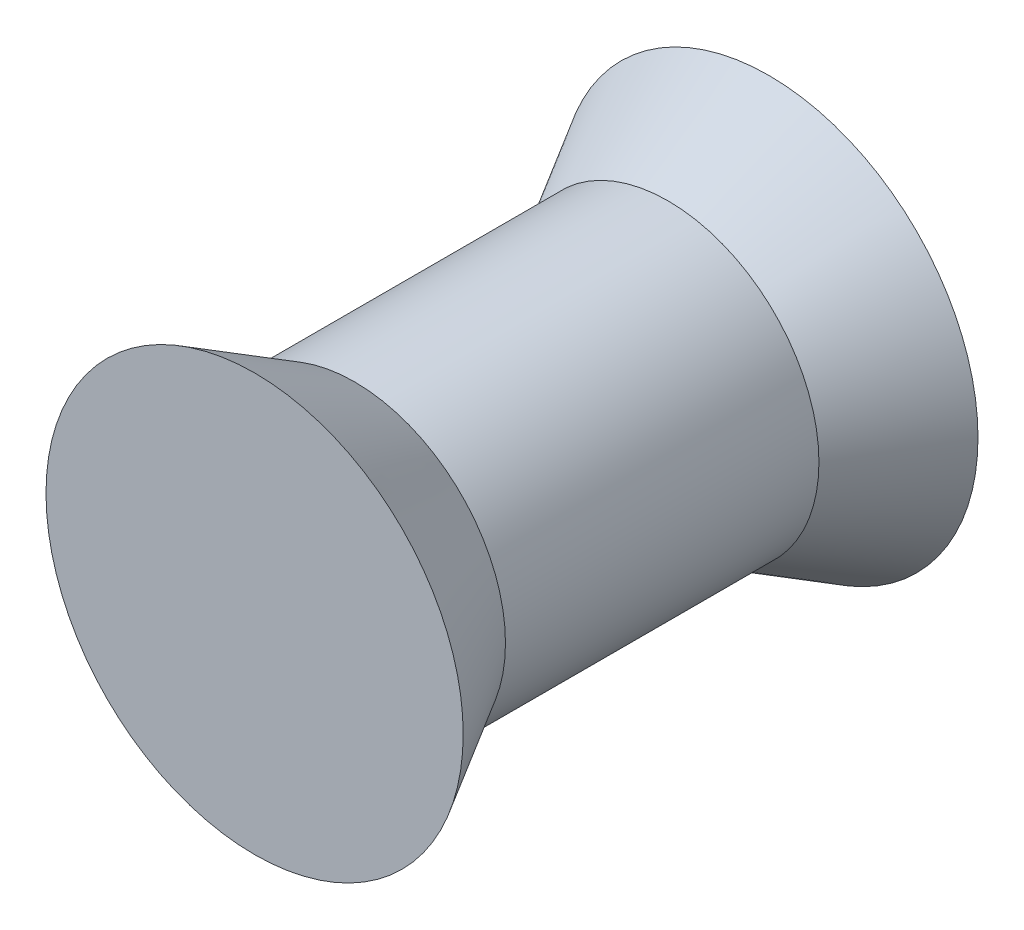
ISO-10303-21;
HEADER;
FILE_DESCRIPTION(('STEP AP214'),'2;1');
FILE_NAME('part.step','',(''),(''),'','','');
FILE_SCHEMA(('AUTOMOTIVE_DESIGN { 1 0 10303 214 1 1 1 1 }'));
ENDSEC;
DATA;
#1=APPLICATION_CONTEXT('core data for automotive mechanical design processes');
#2=APPLICATION_PROTOCOL_DEFINITION('international standard','automotive_design',2000,#1);
#3=PRODUCT_CONTEXT('',#1,'mechanical');
#4=PRODUCT('Part','Part','',(#3));
#5=PRODUCT_RELATED_PRODUCT_CATEGORY('part','',(#4));
#6=PRODUCT_DEFINITION_FORMATION('','',#4);
#7=PRODUCT_DEFINITION_CONTEXT('part definition',#1,'design');
#8=PRODUCT_DEFINITION('design','',#6,#7);
#9=PRODUCT_DEFINITION_SHAPE('','',#8);
#10=(LENGTH_UNIT() NAMED_UNIT(*) SI_UNIT(.MILLI.,.METRE.));
#11=(NAMED_UNIT(*) PLANE_ANGLE_UNIT() SI_UNIT($,.RADIAN.));
#12=(NAMED_UNIT(*) SI_UNIT($,.STERADIAN.) SOLID_ANGLE_UNIT());
#13=UNCERTAINTY_MEASURE_WITH_UNIT(LENGTH_MEASURE(1.E-05),#10,'distance_accuracy_value','');
#14=(GEOMETRIC_REPRESENTATION_CONTEXT(3) GLOBAL_UNCERTAINTY_ASSIGNED_CONTEXT((#13)) GLOBAL_UNIT_ASSIGNED_CONTEXT((#10,
#11,#12)) REPRESENTATION_CONTEXT('',''));
#15=CARTESIAN_POINT('',(0.,0.,0.));
#16=DIRECTION('',(0.,0.,1.));
#17=DIRECTION('',(1.,0.,0.));
#18=AXIS2_PLACEMENT_3D('',#15,#16,#17);
#19=CARTESIAN_POINT('',(0.,0.,-2.66715174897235));
#20=DIRECTION('',(0.,0.,1.));
#21=DIRECTION('',(0.,1.,0.));
#22=AXIS2_PLACEMENT_3D('',#19,#20,#21);
#23=SPHERICAL_SURFACE('',#22,6.35);
#24=CARTESIAN_POINT('',(0.,0.,-8.09752));
#25=DIRECTION('',(0.,0.,1.));
#26=DIRECTION('',(1.,0.,0.));
#27=AXIS2_PLACEMENT_3D('',#24,#25,#26);
#28=CIRCLE('',#27,3.29144355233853);
#29=CARTESIAN_POINT('',(3.29144355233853,0.,-8.09752));
#30=VERTEX_POINT('',#29);
#31=EDGE_CURVE('E10',#30,#30,#28,.T.);
#32=ORIENTED_EDGE('',*,*,#31,.F.);
#33=EDGE_LOOP('',(#32));
#34=FACE_BOUND('',#33,.T.);
#35=ADVANCED_FACE('F35',(#34),#23,.T.);
#36=CARTESIAN_POINT('',(0.,0.,-8.09752));
#37=DIRECTION('',(0.,0.,-1.));
#38=DIRECTION('',(-1.,0.,0.));
#39=AXIS2_PLACEMENT_3D('',#36,#37,#38);
#40=CONICAL_SURFACE('',#39,3.29144355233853,0.5235987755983);
#41=CARTESIAN_POINT('',(0.,0.,-6.51002));
#42=DIRECTION('',(0.,0.,1.));
#43=DIRECTION('',(1.,0.,0.));
#44=AXIS2_PLACEMENT_3D('',#41,#42,#43);
#45=CIRCLE('',#44,2.3749);
#46=CARTESIAN_POINT('',(2.3749,0.,-6.51002));
#47=VERTEX_POINT('',#46);
#48=EDGE_CURVE('E41',#47,#47,#45,.T.);
#49=ORIENTED_EDGE('',*,*,#48,.F.);
#50=EDGE_LOOP('',(#49));
#51=FACE_BOUND('',#50,.T.);
#52=ORIENTED_EDGE('',*,*,#31,.T.);
#53=EDGE_LOOP('',(#52));
#54=FACE_BOUND('',#53,.T.);
#55=ADVANCED_FACE('F65',(#51,#54),#40,.T.);
#56=CARTESIAN_POINT('',(0.,0.,0.));
#57=DIRECTION('',(0.,0.,1.));
#58=DIRECTION('',(1.,0.,0.));
#59=AXIS2_PLACEMENT_3D('',#56,#57,#58);
#60=CYLINDRICAL_SURFACE('',#59,2.3749);
#61=CARTESIAN_POINT('',(0.,0.,-1.5748));
#62=DIRECTION('',(0.,0.,1.));
#63=DIRECTION('',(1.,0.,0.));
#64=AXIS2_PLACEMENT_3D('',#61,#62,#63);
#65=CIRCLE('',#64,2.3749);
#66=CARTESIAN_POINT('',(2.3749,0.,-1.5748));
#67=VERTEX_POINT('',#66);
#68=EDGE_CURVE('E45',#67,#67,#65,.T.);
#69=ORIENTED_EDGE('',*,*,#68,.F.);
#70=EDGE_LOOP('',(#69));
#71=FACE_BOUND('',#70,.T.);
#72=ORIENTED_EDGE('',*,*,#48,.T.);
#73=EDGE_LOOP('',(#72));
#74=FACE_BOUND('',#73,.T.);
#75=ADVANCED_FACE('F60',(#71,#74),#60,.T.);
#76=CARTESIAN_POINT('',(0.,0.,-1.5748));
#77=DIRECTION('',(0.,0.,1.));
#78=DIRECTION('',(1.,0.,0.));
#79=AXIS2_PLACEMENT_3D('',#76,#77,#78);
#80=CONICAL_SURFACE('',#79,2.3749,0.5235987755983);
#81=CARTESIAN_POINT('',(0.,0.,0.));
#82=DIRECTION('',(0.,0.,1.));
#83=DIRECTION('',(1.,0.,0.));
#84=AXIS2_PLACEMENT_3D('',#81,#82,#83);
#85=CIRCLE('',#84,3.28411120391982);
#86=CARTESIAN_POINT('',(3.28411120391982,0.,0.));
#87=VERTEX_POINT('',#86);
#88=EDGE_CURVE('E49',#87,#87,#85,.T.);
#89=ORIENTED_EDGE('',*,*,#88,.F.);
#90=EDGE_LOOP('',(#89));
#91=FACE_BOUND('',#90,.T.);
#92=ORIENTED_EDGE('',*,*,#68,.T.);
#93=EDGE_LOOP('',(#92));
#94=FACE_BOUND('',#93,.T.);
#95=ADVANCED_FACE('F57',(#91,#94),#80,.T.);
#96=CARTESIAN_POINT('',(0.,3.28411120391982,0.));
#97=DIRECTION('',(0.,0.,-1.));
#98=DIRECTION('',(-1.,0.,0.));
#99=AXIS2_PLACEMENT_3D('',#96,#97,#98);
#100=PLANE('',#99);
#101=ORIENTED_EDGE('',*,*,#88,.T.);
#102=EDGE_LOOP('',(#101));
#103=FACE_BOUND('',#102,.T.);
#104=ADVANCED_FACE('F55',(#103),#100,.F.);
#105=CLOSED_SHELL('',(#35,#55,#75,#95,#104));
#106=MANIFOLD_SOLID_BREP('B2',#105);
#107=ADVANCED_BREP_SHAPE_REPRESENTATION('',(#18,#106),#14);
#108=SHAPE_DEFINITION_REPRESENTATION(#9,#107);
ENDSEC;
END-ISO-10303-21;
